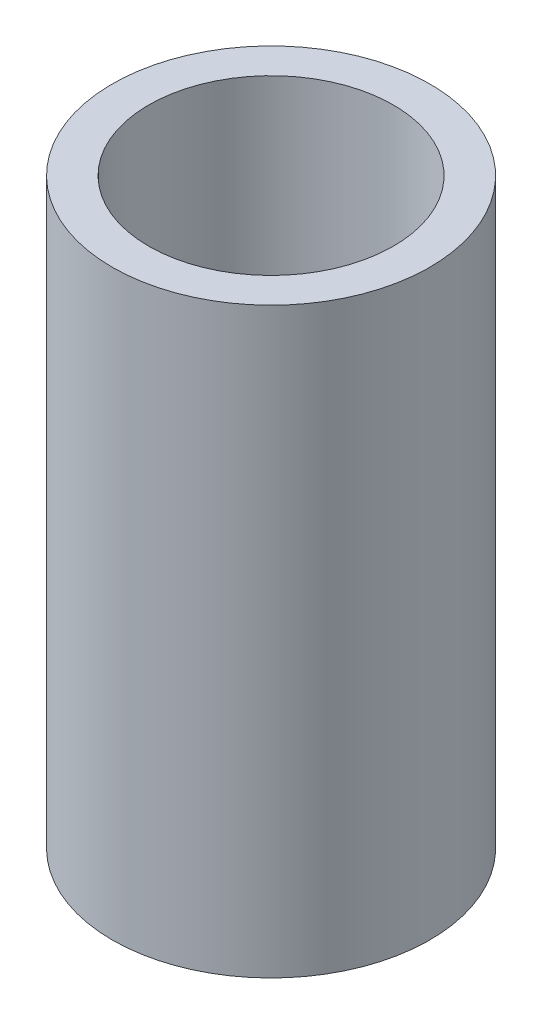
from build123d import *

# Parameters (mm, degrees)
SKETCH1_R           = 21.8
SKETCH1_R_2         = 16.8
BOSS_EXTRUDE1_DEPTH = 80


with BuildPart() as part:
    # Sketch1 → Boss-Extrude1 (new body)
    with BuildSketch(Plane(origin=(0, 0, 0), x_dir=(1, 0, 0), z_dir=(0, 1, 0))):
        with Locations(Location((0, 0, 0), (0, 0, 270))):
            Circle(SKETCH1_R)
        with Locations(Location((0, 0, 0), (0, 0, 270))):
            Circle(SKETCH1_R_2, mode=Mode.SUBTRACT)
    extrude(amount=BOSS_EXTRUDE1_DEPTH)


solid = part.part
